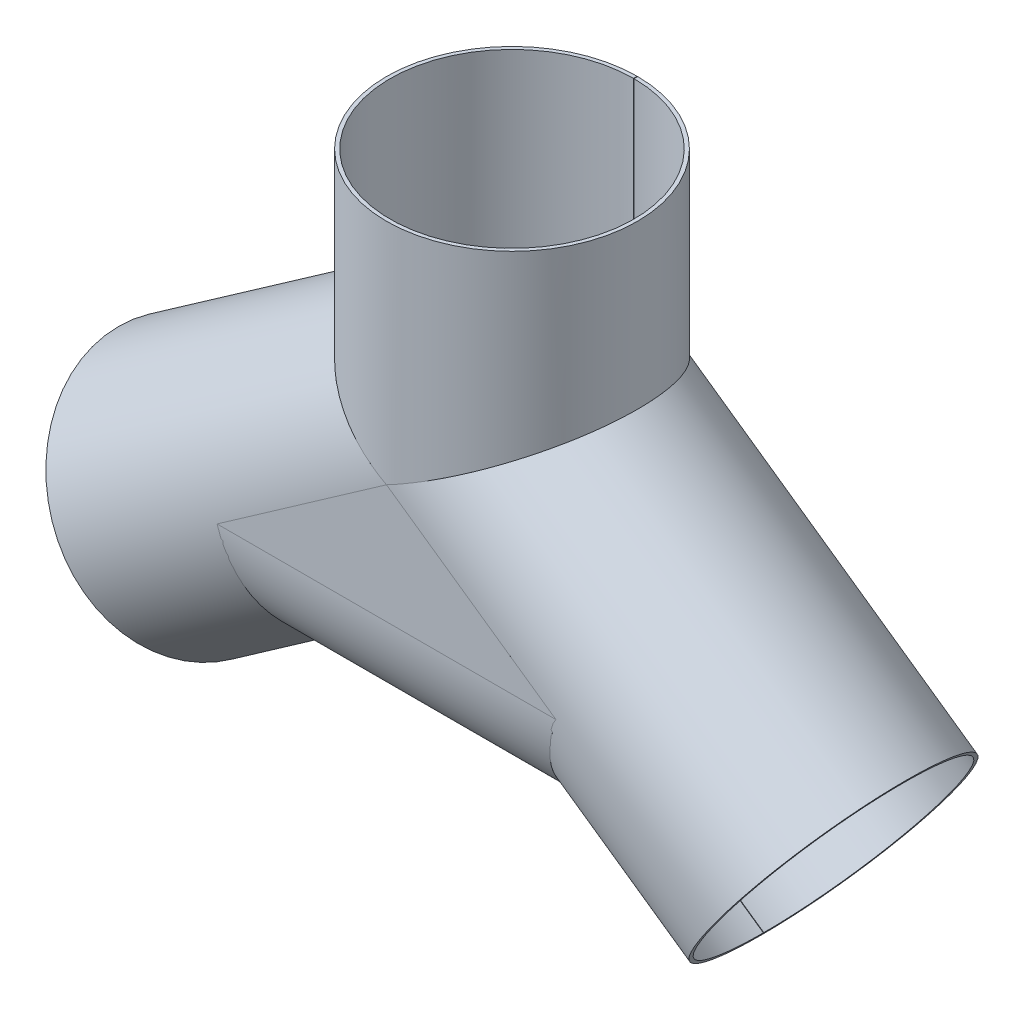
ISO-10303-21;
HEADER;
FILE_DESCRIPTION(('STEP AP214'),'2;1');
FILE_NAME('part.step','',(''),(''),'','','');
FILE_SCHEMA(('AUTOMOTIVE_DESIGN { 1 0 10303 214 1 1 1 1 }'));
ENDSEC;
DATA;
#1=APPLICATION_CONTEXT('core data for automotive mechanical design processes');
#2=APPLICATION_PROTOCOL_DEFINITION('international standard','automotive_design',2000,#1);
#3=PRODUCT_CONTEXT('',#1,'mechanical');
#4=PRODUCT('Part','Part','',(#3));
#5=PRODUCT_RELATED_PRODUCT_CATEGORY('part','',(#4));
#6=PRODUCT_DEFINITION_FORMATION('','',#4);
#7=PRODUCT_DEFINITION_CONTEXT('part definition',#1,'design');
#8=PRODUCT_DEFINITION('design','',#6,#7);
#9=PRODUCT_DEFINITION_SHAPE('','',#8);
#10=(LENGTH_UNIT() NAMED_UNIT(*) SI_UNIT(.MILLI.,.METRE.));
#11=(NAMED_UNIT(*) PLANE_ANGLE_UNIT() SI_UNIT($,.RADIAN.));
#12=(NAMED_UNIT(*) SI_UNIT($,.STERADIAN.) SOLID_ANGLE_UNIT());
#13=UNCERTAINTY_MEASURE_WITH_UNIT(LENGTH_MEASURE(1.E-05),#10,'distance_accuracy_value','');
#14=(GEOMETRIC_REPRESENTATION_CONTEXT(3) GLOBAL_UNCERTAINTY_ASSIGNED_CONTEXT((#13)) GLOBAL_UNIT_ASSIGNED_CONTEXT((#10,
#11,#12)) REPRESENTATION_CONTEXT('',''));
#15=CARTESIAN_POINT('',(0.,0.,0.));
#16=DIRECTION('',(0.,0.,1.));
#17=DIRECTION('',(1.,0.,0.));
#18=AXIS2_PLACEMENT_3D('',#15,#16,#17);
#19=CARTESIAN_POINT('',(-371.318481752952,-260.,0.));
#20=DIRECTION('',(1.,0.,0.));
#21=DIRECTION('',(0.,0.,-1.));
#22=AXIS2_PLACEMENT_3D('',#19,#20,#21);
#23=CYLINDRICAL_SURFACE('',#22,275.);
#24=DIRECTION('',(-1.,0.,0.));
#25=VECTOR('',#24,1.);
#26=CARTESIAN_POINT('',(3410.86627632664,-260.,-275.));
#27=LINE('',#26,#25);
#28=CARTESIAN_POINT('',(371.318481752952,-260.,-275.));
#29=VERTEX_POINT('',#28);
#30=CARTESIAN_POINT('',(-371.318481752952,-259.999999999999,-275.));
#31=VERTEX_POINT('',#30);
#32=EDGE_CURVE('E131',#29,#31,#27,.T.);
#33=ORIENTED_EDGE('',*,*,#32,.F.);
#34=CARTESIAN_POINT('',(371.318481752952,-260.,0.));
#35=DIRECTION('',(0.953716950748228,-0.300705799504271,0.));
#36=DIRECTION('',(0.300705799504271,0.953716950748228,0.));
#37=AXIS2_PLACEMENT_3D('',#34,#35,#36);
#38=ELLIPSE('',#37,288.345509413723,275.);
#39=CARTESIAN_POINT('',(371.318481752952,-260.,275.));
#40=VERTEX_POINT('',#39);
#41=EDGE_CURVE('E115',#29,#40,#38,.F.);
#42=ORIENTED_EDGE('',*,*,#41,.T.);
#43=DIRECTION('',(-1.,0.,0.));
#44=VECTOR('',#43,1.);
#45=CARTESIAN_POINT('',(3410.86627632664,-260.,275.));
#46=LINE('',#45,#44);
#47=CARTESIAN_POINT('',(-371.318481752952,-260.,275.));
#48=VERTEX_POINT('',#47);
#49=EDGE_CURVE('E129',#40,#48,#46,.T.);
#50=ORIENTED_EDGE('',*,*,#49,.T.);
#51=CARTESIAN_POINT('',(-371.318481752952,-260.,0.));
#52=DIRECTION('',(-0.953716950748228,-0.300705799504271,0.));
#53=DIRECTION('',(0.300705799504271,-0.953716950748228,0.));
#54=AXIS2_PLACEMENT_3D('',#51,#52,#53);
#55=ELLIPSE('',#54,288.345509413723,275.);
#56=EDGE_CURVE('E190',#48,#31,#55,.F.);
#57=ORIENTED_EDGE('',*,*,#56,.T.);
#58=EDGE_LOOP('',(#33,#42,#50,#57));
#59=FACE_BOUND('',#58,.T.);
#60=ADVANCED_FACE('F66',(#59),#23,.T.);
#61=CARTESIAN_POINT('',(-371.318481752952,-260.,0.));
#62=DIRECTION('',(1.,0.,0.));
#63=DIRECTION('',(0.,0.,-1.));
#64=AXIS2_PLACEMENT_3D('',#61,#62,#63);
#65=CYLINDRICAL_SURFACE('',#64,267.);
#66=CARTESIAN_POINT('',(371.318481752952,-260.,0.));
#67=DIRECTION('',(0.953716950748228,-0.300705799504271,0.));
#68=DIRECTION('',(0.300705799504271,0.953716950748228,0.));
#69=AXIS2_PLACEMENT_3D('',#66,#67,#68);
#70=ELLIPSE('',#69,279.957276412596,267.);
#71=CARTESIAN_POINT('',(371.318481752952,-260.,-267.));
#72=VERTEX_POINT('',#71);
#73=CARTESIAN_POINT('',(371.318481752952,-259.999999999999,267.));
#74=VERTEX_POINT('',#73);
#75=EDGE_CURVE('E118',#72,#74,#70,.F.);
#76=ORIENTED_EDGE('',*,*,#75,.F.);
#77=DIRECTION('',(1.,0.,0.));
#78=VECTOR('',#77,1.);
#79=CARTESIAN_POINT('',(-371.318481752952,-260.,-267.));
#80=LINE('',#79,#78);
#81=CARTESIAN_POINT('',(-371.318481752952,-260.,-267.));
#82=VERTEX_POINT('',#81);
#83=EDGE_CURVE('E157',#82,#72,#80,.T.);
#84=ORIENTED_EDGE('',*,*,#83,.F.);
#85=CARTESIAN_POINT('',(-371.318481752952,-260.,0.));
#86=DIRECTION('',(-0.953716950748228,-0.300705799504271,0.));
#87=DIRECTION('',(0.300705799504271,-0.953716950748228,0.));
#88=AXIS2_PLACEMENT_3D('',#85,#86,#87);
#89=ELLIPSE('',#88,279.957276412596,267.);
#90=CARTESIAN_POINT('',(-371.318481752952,-259.999999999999,267.));
#91=VERTEX_POINT('',#90);
#92=EDGE_CURVE('E132',#91,#82,#89,.F.);
#93=ORIENTED_EDGE('',*,*,#92,.F.);
#94=DIRECTION('',(1.,0.,0.));
#95=VECTOR('',#94,1.);
#96=CARTESIAN_POINT('',(-371.318481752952,-260.,267.));
#97=LINE('',#96,#95);
#98=EDGE_CURVE('E152',#74,#91,#97,.F.);
#99=ORIENTED_EDGE('',*,*,#98,.F.);
#100=EDGE_LOOP('',(#76,#84,#93,#99));
#101=FACE_BOUND('',#100,.T.);
#102=ADVANCED_FACE('F174',(#101),#65,.F.);
#103=CARTESIAN_POINT('',(-371.318481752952,-260.,267.));
#104=DIRECTION('',(-0.573576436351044,0.819152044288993,0.));
#105=DIRECTION('',(-0.819152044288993,-0.573576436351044,0.));
#106=AXIS2_PLACEMENT_3D('',#103,#104,#105);
#107=PLANE('',#106);
#108=DIRECTION('',(-0.819152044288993,-0.573576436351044,0.));
#109=VECTOR('',#108,1.);
#110=CARTESIAN_POINT('',(-371.318481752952,-260.,275.));
#111=LINE('',#110,#109);
#112=CARTESIAN_POINT('',(0.,0.,275.));
#113=VERTEX_POINT('',#112);
#114=EDGE_CURVE('E139',#113,#48,#111,.T.);
#115=ORIENTED_EDGE('',*,*,#114,.F.);
#116=DIRECTION('',(0.,0.,1.));
#117=VECTOR('',#116,1.);
#118=CARTESIAN_POINT('',(0.,0.,267.));
#119=LINE('',#118,#117);
#120=CARTESIAN_POINT('',(0.,0.,267.));
#121=VERTEX_POINT('',#120);
#122=EDGE_CURVE('E80',#121,#113,#119,.T.);
#123=ORIENTED_EDGE('',*,*,#122,.F.);
#124=DIRECTION('',(-0.819152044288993,-0.573576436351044,0.));
#125=VECTOR('',#124,1.);
#126=CARTESIAN_POINT('',(-371.318481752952,-260.,267.));
#127=LINE('',#126,#125);
#128=EDGE_CURVE('E143',#121,#91,#127,.T.);
#129=ORIENTED_EDGE('',*,*,#128,.T.);
#130=DIRECTION('',(0.,0.,1.));
#131=VECTOR('',#130,1.);
#132=CARTESIAN_POINT('',(-371.318481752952,-260.,0.));
#133=LINE('',#132,#131);
#134=EDGE_CURVE('E156',#91,#48,#133,.T.);
#135=ORIENTED_EDGE('',*,*,#134,.T.);
#136=EDGE_LOOP('',(#115,#123,#129,#135));
#137=FACE_BOUND('',#136,.T.);
#138=ADVANCED_FACE('F193',(#137),#107,.T.);
#139=CARTESIAN_POINT('',(0.,0.,267.));
#140=DIRECTION('',(0.573576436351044,0.819152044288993,0.));
#141=DIRECTION('',(-0.819152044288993,0.573576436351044,0.));
#142=AXIS2_PLACEMENT_3D('',#139,#140,#141);
#143=PLANE('',#142);
#144=DIRECTION('',(-0.819152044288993,0.573576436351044,0.));
#145=VECTOR('',#144,1.);
#146=CARTESIAN_POINT('',(0.,0.,275.));
#147=LINE('',#146,#145);
#148=EDGE_CURVE('E138',#40,#113,#147,.T.);
#149=ORIENTED_EDGE('',*,*,#148,.F.);
#150=DIRECTION('',(0.,0.,1.));
#151=VECTOR('',#150,1.);
#152=CARTESIAN_POINT('',(371.318481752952,-260.,0.));
#153=LINE('',#152,#151);
#154=EDGE_CURVE('E69',#74,#40,#153,.T.);
#155=ORIENTED_EDGE('',*,*,#154,.F.);
#156=DIRECTION('',(-0.819152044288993,0.573576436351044,0.));
#157=VECTOR('',#156,1.);
#158=CARTESIAN_POINT('',(0.,0.,267.));
#159=LINE('',#158,#157);
#160=EDGE_CURVE('E145',#74,#121,#159,.T.);
#161=ORIENTED_EDGE('',*,*,#160,.T.);
#162=ORIENTED_EDGE('',*,*,#122,.T.);
#163=EDGE_LOOP('',(#149,#155,#161,#162));
#164=FACE_BOUND('',#163,.T.);
#165=ADVANCED_FACE('F142',(#164),#143,.T.);
#166=CARTESIAN_POINT('',(0.,0.,267.));
#167=DIRECTION('',(0.,0.,-1.));
#168=DIRECTION('',(-1.,0.,0.));
#169=AXIS2_PLACEMENT_3D('',#166,#167,#168);
#170=PLANE('',#169);
#171=ORIENTED_EDGE('',*,*,#128,.F.);
#172=ORIENTED_EDGE('',*,*,#160,.F.);
#173=ORIENTED_EDGE('',*,*,#98,.T.);
#174=EDGE_LOOP('',(#171,#172,#173));
#175=FACE_BOUND('',#174,.T.);
#176=ADVANCED_FACE('F192',(#175),#170,.T.);
#177=CARTESIAN_POINT('',(0.,0.,275.));
#178=DIRECTION('',(0.,0.,-1.));
#179=DIRECTION('',(-1.,0.,0.));
#180=AXIS2_PLACEMENT_3D('',#177,#178,#179);
#181=PLANE('',#180);
#182=ORIENTED_EDGE('',*,*,#114,.T.);
#183=ORIENTED_EDGE('',*,*,#49,.F.);
#184=ORIENTED_EDGE('',*,*,#148,.T.);
#185=EDGE_LOOP('',(#182,#183,#184));
#186=FACE_BOUND('',#185,.T.);
#187=ADVANCED_FACE('F137',(#186),#181,.F.);
#188=CARTESIAN_POINT('',(-371.318481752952,-260.,-267.));
#189=DIRECTION('',(0.573576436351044,-0.819152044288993,0.));
#190=DIRECTION('',(0.819152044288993,0.573576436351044,0.));
#191=AXIS2_PLACEMENT_3D('',#188,#189,#190);
#192=PLANE('',#191);
#193=DIRECTION('',(-0.819152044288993,-0.573576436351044,0.));
#194=VECTOR('',#193,1.);
#195=CARTESIAN_POINT('',(-371.318481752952,-260.,-275.));
#196=LINE('',#195,#194);
#197=CARTESIAN_POINT('',(0.,0.,-275.));
#198=VERTEX_POINT('',#197);
#199=EDGE_CURVE('E170',#198,#31,#196,.T.);
#200=ORIENTED_EDGE('',*,*,#199,.T.);
#201=EDGE_CURVE('E123',#31,#82,#133,.T.);
#202=ORIENTED_EDGE('',*,*,#201,.T.);
#203=DIRECTION('',(-0.819152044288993,-0.573576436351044,0.));
#204=VECTOR('',#203,1.);
#205=CARTESIAN_POINT('',(-371.318481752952,-260.,-267.));
#206=LINE('',#205,#204);
#207=CARTESIAN_POINT('',(0.,0.,-267.));
#208=VERTEX_POINT('',#207);
#209=EDGE_CURVE('E168',#208,#82,#206,.T.);
#210=ORIENTED_EDGE('',*,*,#209,.F.);
#211=DIRECTION('',(0.,0.,-1.));
#212=VECTOR('',#211,1.);
#213=CARTESIAN_POINT('',(0.,0.,-267.));
#214=LINE('',#213,#212);
#215=EDGE_CURVE('E147',#208,#198,#214,.T.);
#216=ORIENTED_EDGE('',*,*,#215,.T.);
#217=EDGE_LOOP('',(#200,#202,#210,#216));
#218=FACE_BOUND('',#217,.T.);
#219=ADVANCED_FACE('F166',(#218),#192,.F.);
#220=CARTESIAN_POINT('',(0.,0.,-267.));
#221=DIRECTION('',(-0.573576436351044,-0.819152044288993,0.));
#222=DIRECTION('',(0.819152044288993,-0.573576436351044,0.));
#223=AXIS2_PLACEMENT_3D('',#220,#221,#222);
#224=PLANE('',#223);
#225=DIRECTION('',(-0.819152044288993,0.573576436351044,0.));
#226=VECTOR('',#225,1.);
#227=CARTESIAN_POINT('',(0.,0.,-275.));
#228=LINE('',#227,#226);
#229=EDGE_CURVE('E185',#29,#198,#228,.T.);
#230=ORIENTED_EDGE('',*,*,#229,.T.);
#231=ORIENTED_EDGE('',*,*,#215,.F.);
#232=DIRECTION('',(-0.819152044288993,0.573576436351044,0.));
#233=VECTOR('',#232,1.);
#234=CARTESIAN_POINT('',(0.,0.,-267.));
#235=LINE('',#234,#233);
#236=EDGE_CURVE('E180',#72,#208,#235,.T.);
#237=ORIENTED_EDGE('',*,*,#236,.F.);
#238=EDGE_CURVE('E14',#29,#72,#153,.T.);
#239=ORIENTED_EDGE('',*,*,#238,.F.);
#240=EDGE_LOOP('',(#230,#231,#237,#239));
#241=FACE_BOUND('',#240,.T.);
#242=ADVANCED_FACE('F181',(#241),#224,.F.);
#243=CARTESIAN_POINT('',(0.,0.,-267.));
#244=DIRECTION('',(0.,0.,1.));
#245=DIRECTION('',(-1.,0.,0.));
#246=AXIS2_PLACEMENT_3D('',#243,#244,#245);
#247=PLANE('',#246);
#248=ORIENTED_EDGE('',*,*,#209,.T.);
#249=ORIENTED_EDGE('',*,*,#83,.T.);
#250=ORIENTED_EDGE('',*,*,#236,.T.);
#251=EDGE_LOOP('',(#248,#249,#250));
#252=FACE_BOUND('',#251,.T.);
#253=ADVANCED_FACE('F199',(#252),#247,.T.);
#254=CARTESIAN_POINT('',(0.,0.,-275.));
#255=DIRECTION('',(0.,0.,1.));
#256=DIRECTION('',(-1.,0.,0.));
#257=AXIS2_PLACEMENT_3D('',#254,#255,#256);
#258=PLANE('',#257);
#259=ORIENTED_EDGE('',*,*,#199,.F.);
#260=ORIENTED_EDGE('',*,*,#229,.F.);
#261=ORIENTED_EDGE('',*,*,#32,.T.);
#262=EDGE_LOOP('',(#259,#260,#261));
#263=FACE_BOUND('',#262,.T.);
#264=ADVANCED_FACE('F197',(#263),#258,.F.);
#265=CARTESIAN_POINT('',(0.,-1437.67176674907,-275.));
#266=DIRECTION('',(0.953716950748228,-0.300705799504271,0.));
#267=DIRECTION('',(0.300705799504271,0.953716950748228,0.));
#268=AXIS2_PLACEMENT_3D('',#265,#266,#267);
#269=PLANE('',#268);
#270=ORIENTED_EDGE('',*,*,#41,.F.);
#271=ORIENTED_EDGE('',*,*,#238,.T.);
#272=ORIENTED_EDGE('',*,*,#75,.T.);
#273=ORIENTED_EDGE('',*,*,#154,.T.);
#274=EDGE_LOOP('',(#270,#271,#272,#273));
#275=FACE_BOUND('',#274,.T.);
#276=ADVANCED_FACE('F114',(#275),#269,.T.);
#277=CARTESIAN_POINT('',(-742.636963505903,917.671766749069,-275.));
#278=DIRECTION('',(-0.953716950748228,-0.300705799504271,0.));
#279=DIRECTION('',(0.300705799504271,-0.953716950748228,0.));
#280=AXIS2_PLACEMENT_3D('',#277,#278,#279);
#281=PLANE('',#280);
#282=ORIENTED_EDGE('',*,*,#134,.F.);
#283=ORIENTED_EDGE('',*,*,#92,.T.);
#284=ORIENTED_EDGE('',*,*,#201,.F.);
#285=ORIENTED_EDGE('',*,*,#56,.F.);
#286=EDGE_LOOP('',(#282,#283,#284,#285));
#287=FACE_BOUND('',#286,.T.);
#288=ADVANCED_FACE('F194',(#287),#281,.T.);
#289=CLOSED_SHELL('',(#60,#102,#138,#165,#176,#187,#219,#242,#253,#264,#276,#288));
#290=MANIFOLD_SOLID_BREP('B2',#289);
#291=CARTESIAN_POINT('',(1.11022302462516E-13,1.66533453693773E-13,0.));
#292=DIRECTION('',(-0.819152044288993,-0.573576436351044,0.));
#293=DIRECTION('',(-0.573576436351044,0.819152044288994,0.));
#294=AXIS2_PLACEMENT_3D('',#291,#292,#293);
#295=CYLINDRICAL_SURFACE('',#294,275.);
#296=CARTESIAN_POINT('',(-704.470758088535,-493.275735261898,0.));
#297=DIRECTION('',(0.819152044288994,0.573576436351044,0.));
#298=DIRECTION('',(-0.573576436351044,0.819152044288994,0.));
#299=AXIS2_PLACEMENT_3D('',#296,#297,#298);
#300=CIRCLE('',#299,275.);
#301=CARTESIAN_POINT('',(-546.737498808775,-718.542175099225,-0.500000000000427));
#302=VERTEX_POINT('',#301);
#303=CARTESIAN_POINT('',(-546.737498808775,-718.542175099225,0.499999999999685));
#304=VERTEX_POINT('',#303);
#305=EDGE_CURVE('E371',#302,#304,#300,.T.);
#306=ORIENTED_EDGE('',*,*,#305,.T.);
#307=DIRECTION('',(-0.819152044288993,-0.573576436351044,0.));
#308=VECTOR('',#307,1.);
#309=CARTESIAN_POINT('',(157.73325927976,-225.266439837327,0.499999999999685));
#310=LINE('',#309,#308);
#311=CARTESIAN_POINT('',(0.,-335.712457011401,0.499999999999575));
#312=VERTEX_POINT('',#311);
#313=EDGE_CURVE('E360',#304,#312,#310,.F.);
#314=ORIENTED_EDGE('',*,*,#313,.T.);
#315=CARTESIAN_POINT('',(0.,1.12068877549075E-13,0.));
#316=DIRECTION('',(-1.,0.,0.));
#317=DIRECTION('',(0.,-1.,0.));
#318=AXIS2_PLACEMENT_3D('',#315,#316,#317);
#319=ELLIPSE('',#318,335.7130119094,275.);
#320=CARTESIAN_POINT('',(0.,6.66133814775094E-13,275.));
#321=VERTEX_POINT('',#320);
#322=EDGE_CURVE('E372',#321,#312,#319,.F.);
#323=ORIENTED_EDGE('',*,*,#322,.F.);
#324=CARTESIAN_POINT('',(4.18608667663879E-13,3.81907745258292E-13,0.));
#325=DIRECTION('',(0.461748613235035,0.887010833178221,0.));
#326=DIRECTION('',(-0.887010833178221,0.461748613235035,0.));
#327=AXIS2_PLACEMENT_3D('',#324,#325,#326);
#328=ELLIPSE('',#327,310.030035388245,275.);
#329=CARTESIAN_POINT('',(-3.02707862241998E-13,7.57401363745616E-13,-275.));
#330=VERTEX_POINT('',#329);
#331=EDGE_CURVE('E389',#321,#330,#328,.F.);
#332=ORIENTED_EDGE('',*,*,#331,.T.);
#333=CARTESIAN_POINT('',(0.,-335.712457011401,-0.500000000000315));
#334=VERTEX_POINT('',#333);
#335=EDGE_CURVE('E395',#334,#330,#319,.F.);
#336=ORIENTED_EDGE('',*,*,#335,.F.);
#337=DIRECTION('',(-0.819152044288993,-0.573576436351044,0.));
#338=VECTOR('',#337,1.);
#339=CARTESIAN_POINT('',(157.73325927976,-225.266439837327,-0.500000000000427));
#340=LINE('',#339,#338);
#341=EDGE_CURVE('E384',#302,#334,#340,.F.);
#342=ORIENTED_EDGE('',*,*,#341,.F.);
#343=EDGE_LOOP('',(#306,#314,#323,#332,#336,#342));
#344=FACE_BOUND('',#343,.T.);
#345=ADVANCED_FACE('F305',(#344),#295,.T.);
#346=CARTESIAN_POINT('',(1.11022302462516E-13,1.66533453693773E-13,0.));
#347=DIRECTION('',(-0.819152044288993,-0.573576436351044,0.));
#348=DIRECTION('',(-0.573576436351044,0.819152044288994,0.));
#349=AXIS2_PLACEMENT_3D('',#346,#347,#348);
#350=CYLINDRICAL_SURFACE('',#349,267.);
#351=DIRECTION('',(-0.819152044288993,-0.573576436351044,0.));
#352=VECTOR('',#351,1.);
#353=CARTESIAN_POINT('',(153.144639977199,-218.713212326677,-0.500000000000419));
#354=LINE('',#353,#352);
#355=CARTESIAN_POINT('',(-551.326118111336,-711.988947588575,-0.500000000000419));
#356=VERTEX_POINT('',#355);
#357=CARTESIAN_POINT('',(0.,-325.946243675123,-0.500000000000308));
#358=VERTEX_POINT('',#357);
#359=EDGE_CURVE('E379',#356,#358,#354,.F.);
#360=ORIENTED_EDGE('',*,*,#359,.T.);
#361=CARTESIAN_POINT('',(0.,1.12068877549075E-13,0.));
#362=DIRECTION('',(-1.,0.,0.));
#363=DIRECTION('',(0.,-1.,0.));
#364=AXIS2_PLACEMENT_3D('',#361,#362,#363);
#365=ELLIPSE('',#364,325.946815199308,267.);
#366=CARTESIAN_POINT('',(-3.02707862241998E-13,7.57401363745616E-13,-267.));
#367=VERTEX_POINT('',#366);
#368=EDGE_CURVE('E398',#358,#367,#365,.F.);
#369=ORIENTED_EDGE('',*,*,#368,.T.);
#370=CARTESIAN_POINT('',(4.18608667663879E-13,3.81907745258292E-13,0.));
#371=DIRECTION('',(0.461748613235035,0.887010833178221,0.));
#372=DIRECTION('',(-0.887010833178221,0.461748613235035,0.));
#373=AXIS2_PLACEMENT_3D('',#370,#371,#372);
#374=ELLIPSE('',#373,301.010979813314,267.);
#375=CARTESIAN_POINT('',(0.,2.7761976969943E-13,267.));
#376=VERTEX_POINT('',#375);
#377=EDGE_CURVE('E386',#376,#367,#374,.F.);
#378=ORIENTED_EDGE('',*,*,#377,.F.);
#379=CARTESIAN_POINT('',(0.,-325.946243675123,0.499999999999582));
#380=VERTEX_POINT('',#379);
#381=EDGE_CURVE('E377',#376,#380,#365,.F.);
#382=ORIENTED_EDGE('',*,*,#381,.T.);
#383=DIRECTION('',(-0.819152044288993,-0.573576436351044,0.));
#384=VECTOR('',#383,1.);
#385=CARTESIAN_POINT('',(153.144639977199,-218.713212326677,0.499999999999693));
#386=LINE('',#385,#384);
#387=CARTESIAN_POINT('',(-551.326118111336,-711.988947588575,0.499999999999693));
#388=VERTEX_POINT('',#387);
#389=EDGE_CURVE('E357',#388,#380,#386,.F.);
#390=ORIENTED_EDGE('',*,*,#389,.F.);
#391=CARTESIAN_POINT('',(-704.470758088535,-493.275735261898,0.));
#392=DIRECTION('',(0.819152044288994,0.573576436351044,0.));
#393=DIRECTION('',(0.,0.,-1.));
#394=AXIS2_PLACEMENT_3D('',#391,#392,#393);
#395=CIRCLE('',#394,267.);
#396=EDGE_CURVE('E367',#356,#388,#395,.T.);
#397=ORIENTED_EDGE('',*,*,#396,.F.);
#398=EDGE_LOOP('',(#360,#369,#378,#382,#390,#397));
#399=FACE_BOUND('',#398,.T.);
#400=ADVANCED_FACE('F374',(#399),#350,.F.);
#401=CARTESIAN_POINT('',(-704.470758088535,-493.275735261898,0.));
#402=DIRECTION('',(-0.819152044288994,-0.573576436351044,0.));
#403=DIRECTION('',(-0.573576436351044,0.819152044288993,0.));
#404=AXIS2_PLACEMENT_3D('',#401,#402,#403);
#405=PLANE('',#404);
#406=ORIENTED_EDGE('',*,*,#396,.T.);
#407=DIRECTION('',(0.573576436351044,-0.819152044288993,0.));
#408=VECTOR('',#407,1.);
#409=CARTESIAN_POINT('',(-704.470758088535,-493.275735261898,0.499999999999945));
#410=LINE('',#409,#408);
#411=EDGE_CURVE('E353',#388,#304,#410,.T.);
#412=ORIENTED_EDGE('',*,*,#411,.T.);
#413=ORIENTED_EDGE('',*,*,#305,.F.);
#414=DIRECTION('',(0.573576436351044,-0.819152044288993,0.));
#415=VECTOR('',#414,1.);
#416=CARTESIAN_POINT('',(-704.470758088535,-493.275735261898,-0.500000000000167));
#417=LINE('',#416,#415);
#418=EDGE_CURVE('E364',#356,#302,#417,.T.);
#419=ORIENTED_EDGE('',*,*,#418,.F.);
#420=EDGE_LOOP('',(#406,#412,#413,#419));
#421=FACE_BOUND('',#420,.T.);
#422=ADVANCED_FACE('F368',(#421),#405,.T.);
#423=CARTESIAN_POINT('',(0.,-718.542547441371,2537.69746619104));
#424=DIRECTION('',(1.,0.,0.));
#425=DIRECTION('',(0.,-1.,0.));
#426=AXIS2_PLACEMENT_3D('',#423,#424,#425);
#427=PLANE('',#426);
#428=ORIENTED_EDGE('',*,*,#335,.T.);
#429=DIRECTION('',(0.,0.,-1.));
#430=VECTOR('',#429,1.);
#431=CARTESIAN_POINT('',(0.,2.7761976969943E-13,0.));
#432=LINE('',#431,#430);
#433=EDGE_CURVE('E392',#367,#330,#432,.T.);
#434=ORIENTED_EDGE('',*,*,#433,.F.);
#435=ORIENTED_EDGE('',*,*,#368,.F.);
#436=DIRECTION('',(0.,1.,0.));
#437=VECTOR('',#436,1.);
#438=CARTESIAN_POINT('',(0.,-718.542547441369,-0.500000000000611));
#439=LINE('',#438,#437);
#440=EDGE_CURVE('E64',#334,#358,#439,.T.);
#441=ORIENTED_EDGE('',*,*,#440,.F.);
#442=EDGE_LOOP('',(#428,#434,#435,#441));
#443=FACE_BOUND('',#442,.T.);
#444=ADVANCED_FACE('F410',(#443),#427,.T.);
#445=DIRECTION('',(0.,1.,0.));
#446=VECTOR('',#445,1.);
#447=CARTESIAN_POINT('',(0.,-718.542547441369,0.499999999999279));
#448=LINE('',#447,#446);
#449=EDGE_CURVE('E312',#312,#380,#448,.T.);
#450=ORIENTED_EDGE('',*,*,#449,.T.);
#451=ORIENTED_EDGE('',*,*,#381,.F.);
#452=EDGE_CURVE('E394',#321,#376,#432,.T.);
#453=ORIENTED_EDGE('',*,*,#452,.F.);
#454=ORIENTED_EDGE('',*,*,#322,.T.);
#455=EDGE_LOOP('',(#450,#451,#453,#454));
#456=FACE_BOUND('',#455,.T.);
#457=ADVANCED_FACE('F400',(#456),#427,.T.);
#458=CARTESIAN_POINT('',(-704.470758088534,366.724264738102,2537.69746619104));
#459=DIRECTION('',(-0.461748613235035,-0.887010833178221,0.));
#460=DIRECTION('',(-0.887010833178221,0.461748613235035,0.));
#461=AXIS2_PLACEMENT_3D('',#458,#459,#460);
#462=PLANE('',#461);
#463=ORIENTED_EDGE('',*,*,#452,.T.);
#464=ORIENTED_EDGE('',*,*,#377,.T.);
#465=ORIENTED_EDGE('',*,*,#433,.T.);
#466=ORIENTED_EDGE('',*,*,#331,.F.);
#467=EDGE_LOOP('',(#463,#464,#465,#466));
#468=FACE_BOUND('',#467,.T.);
#469=ADVANCED_FACE('F412',(#468),#462,.F.);
#470=CARTESIAN_POINT('',(-2.22044604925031E-13,1.11022302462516E-13,0.499999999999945));
#471=DIRECTION('',(0.,0.,1.));
#472=DIRECTION('',(0.,-1.,0.));
#473=AXIS2_PLACEMENT_3D('',#470,#471,#472);
#474=PLANE('',#473);
#475=ORIENTED_EDGE('',*,*,#313,.F.);
#476=ORIENTED_EDGE('',*,*,#411,.F.);
#477=ORIENTED_EDGE('',*,*,#389,.T.);
#478=ORIENTED_EDGE('',*,*,#449,.F.);
#479=EDGE_LOOP('',(#475,#476,#477,#478));
#480=FACE_BOUND('',#479,.T.);
#481=ADVANCED_FACE('F355',(#480),#474,.F.);
#482=CARTESIAN_POINT('',(-2.22044604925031E-13,1.11022302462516E-13,-0.500000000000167));
#483=DIRECTION('',(0.,0.,1.));
#484=DIRECTION('',(0.,-1.,0.));
#485=AXIS2_PLACEMENT_3D('',#482,#483,#484);
#486=PLANE('',#485);
#487=ORIENTED_EDGE('',*,*,#418,.T.);
#488=ORIENTED_EDGE('',*,*,#341,.T.);
#489=ORIENTED_EDGE('',*,*,#440,.T.);
#490=ORIENTED_EDGE('',*,*,#359,.F.);
#491=EDGE_LOOP('',(#487,#488,#489,#490));
#492=FACE_BOUND('',#491,.T.);
#493=ADVANCED_FACE('F407',(#492),#486,.T.);
#494=CLOSED_SHELL('',(#345,#400,#422,#444,#457,#469,#481,#493));
#495=MANIFOLD_SOLID_BREP('B8',#494);
#496=CARTESIAN_POINT('',(-1.11022302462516E-13,1.66533453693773E-13,0.));
#497=DIRECTION('',(0.819152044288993,-0.573576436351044,0.));
#498=DIRECTION('',(0.573576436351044,0.819152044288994,0.));
#499=AXIS2_PLACEMENT_3D('',#496,#497,#498);
#500=CYLINDRICAL_SURFACE('',#499,275.);
#501=CARTESIAN_POINT('',(704.470758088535,-493.275735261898,0.));
#502=DIRECTION('',(0.819152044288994,-0.573576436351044,0.));
#503=DIRECTION('',(0.573576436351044,0.819152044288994,0.));
#504=AXIS2_PLACEMENT_3D('',#501,#502,#503);
#505=CIRCLE('',#504,275.);
#506=CARTESIAN_POINT('',(546.737498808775,-718.542175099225,-0.500000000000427));
#507=VERTEX_POINT('',#506);
#508=CARTESIAN_POINT('',(546.737498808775,-718.542175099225,0.499999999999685));
#509=VERTEX_POINT('',#508);
#510=EDGE_CURVE('E550',#507,#509,#505,.T.);
#511=ORIENTED_EDGE('',*,*,#510,.F.);
#512=DIRECTION('',(0.819152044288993,-0.573576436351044,0.));
#513=VECTOR('',#512,1.);
#514=CARTESIAN_POINT('',(-157.73325927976,-225.266439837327,-0.500000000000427));
#515=LINE('',#514,#513);
#516=CARTESIAN_POINT('',(0.,-335.712457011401,-0.500000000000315));
#517=VERTEX_POINT('',#516);
#518=EDGE_CURVE('E581',#507,#517,#515,.F.);
#519=ORIENTED_EDGE('',*,*,#518,.T.);
#520=CARTESIAN_POINT('',(0.,1.12068877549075E-13,0.));
#521=DIRECTION('',(-1.,0.,0.));
#522=DIRECTION('',(0.,-1.,0.));
#523=AXIS2_PLACEMENT_3D('',#520,#521,#522);
#524=ELLIPSE('',#523,335.7130119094,275.);
#525=CARTESIAN_POINT('',(3.02707862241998E-13,7.57401363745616E-13,-275.));
#526=VERTEX_POINT('',#525);
#527=EDGE_CURVE('E560',#517,#526,#524,.F.);
#528=ORIENTED_EDGE('',*,*,#527,.T.);
#529=CARTESIAN_POINT('',(-4.18608667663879E-13,3.81907745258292E-13,0.));
#530=DIRECTION('',(0.461748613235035,-0.887010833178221,0.));
#531=DIRECTION('',(0.887010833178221,0.461748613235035,0.));
#532=AXIS2_PLACEMENT_3D('',#529,#530,#531);
#533=ELLIPSE('',#532,310.030035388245,275.);
#534=CARTESIAN_POINT('',(0.,6.66133814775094E-13,275.));
#535=VERTEX_POINT('',#534);
#536=EDGE_CURVE('E579',#535,#526,#533,.F.);
#537=ORIENTED_EDGE('',*,*,#536,.F.);
#538=CARTESIAN_POINT('',(0.,-335.712457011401,0.499999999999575));
#539=VERTEX_POINT('',#538);
#540=EDGE_CURVE('E555',#535,#539,#524,.F.);
#541=ORIENTED_EDGE('',*,*,#540,.T.);
#542=DIRECTION('',(0.819152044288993,-0.573576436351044,0.));
#543=VECTOR('',#542,1.);
#544=CARTESIAN_POINT('',(-157.73325927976,-225.266439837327,0.499999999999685));
#545=LINE('',#544,#543);
#546=EDGE_CURVE('E506',#509,#539,#545,.F.);
#547=ORIENTED_EDGE('',*,*,#546,.F.);
#548=EDGE_LOOP('',(#511,#519,#528,#537,#541,#547));
#549=FACE_BOUND('',#548,.T.);
#550=ADVANCED_FACE('F485',(#549),#500,.T.);
#551=CARTESIAN_POINT('',(-1.11022302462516E-13,1.66533453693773E-13,0.));
#552=DIRECTION('',(0.819152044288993,-0.573576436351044,0.));
#553=DIRECTION('',(0.573576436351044,0.819152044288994,0.));
#554=AXIS2_PLACEMENT_3D('',#551,#552,#553);
#555=CYLINDRICAL_SURFACE('',#554,267.);
#556=DIRECTION('',(0.819152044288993,-0.573576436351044,0.));
#557=VECTOR('',#556,1.);
#558=CARTESIAN_POINT('',(-153.144639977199,-218.713212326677,-0.500000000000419));
#559=LINE('',#558,#557);
#560=CARTESIAN_POINT('',(551.326118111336,-711.988947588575,-0.500000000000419));
#561=VERTEX_POINT('',#560);
#562=CARTESIAN_POINT('',(0.,-325.946243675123,-0.500000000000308));
#563=VERTEX_POINT('',#562);
#564=EDGE_CURVE('E499',#561,#563,#559,.F.);
#565=ORIENTED_EDGE('',*,*,#564,.F.);
#566=CARTESIAN_POINT('',(704.470758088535,-493.275735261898,0.));
#567=DIRECTION('',(0.819152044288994,-0.573576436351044,0.));
#568=DIRECTION('',(0.,0.,-1.));
#569=AXIS2_PLACEMENT_3D('',#566,#567,#568);
#570=CIRCLE('',#569,267.);
#571=CARTESIAN_POINT('',(551.326118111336,-711.988947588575,0.499999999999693));
#572=VERTEX_POINT('',#571);
#573=EDGE_CURVE('E548',#561,#572,#570,.T.);
#574=ORIENTED_EDGE('',*,*,#573,.T.);
#575=DIRECTION('',(0.819152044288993,-0.573576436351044,0.));
#576=VECTOR('',#575,1.);
#577=CARTESIAN_POINT('',(-153.144639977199,-218.713212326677,0.499999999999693));
#578=LINE('',#577,#576);
#579=CARTESIAN_POINT('',(0.,-325.946243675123,0.499999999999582));
#580=VERTEX_POINT('',#579);
#581=EDGE_CURVE('E534',#572,#580,#578,.F.);
#582=ORIENTED_EDGE('',*,*,#581,.T.);
#583=CARTESIAN_POINT('',(0.,1.12068877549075E-13,0.));
#584=DIRECTION('',(-1.,0.,0.));
#585=DIRECTION('',(0.,-1.,0.));
#586=AXIS2_PLACEMENT_3D('',#583,#584,#585);
#587=ELLIPSE('',#586,325.946815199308,267.);
#588=CARTESIAN_POINT('',(0.,2.7761976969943E-13,267.));
#589=VERTEX_POINT('',#588);
#590=EDGE_CURVE('E564',#589,#580,#587,.F.);
#591=ORIENTED_EDGE('',*,*,#590,.F.);
#592=CARTESIAN_POINT('',(-4.18608667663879E-13,3.81907745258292E-13,0.));
#593=DIRECTION('',(0.461748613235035,-0.887010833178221,0.));
#594=DIRECTION('',(0.887010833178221,0.461748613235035,0.));
#595=AXIS2_PLACEMENT_3D('',#592,#593,#594);
#596=ELLIPSE('',#595,301.010979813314,267.);
#597=CARTESIAN_POINT('',(3.02707862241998E-13,7.57401363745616E-13,-267.));
#598=VERTEX_POINT('',#597);
#599=EDGE_CURVE('E577',#589,#598,#596,.F.);
#600=ORIENTED_EDGE('',*,*,#599,.T.);
#601=EDGE_CURVE('E557',#563,#598,#587,.F.);
#602=ORIENTED_EDGE('',*,*,#601,.F.);
#603=EDGE_LOOP('',(#565,#574,#582,#591,#600,#602));
#604=FACE_BOUND('',#603,.T.);
#605=ADVANCED_FACE('F553',(#604),#555,.F.);
#606=CARTESIAN_POINT('',(704.470758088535,-493.275735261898,0.));
#607=DIRECTION('',(0.819152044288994,-0.573576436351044,0.));
#608=DIRECTION('',(0.573576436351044,0.819152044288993,0.));
#609=AXIS2_PLACEMENT_3D('',#606,#607,#608);
#610=PLANE('',#609);
#611=ORIENTED_EDGE('',*,*,#573,.F.);
#612=DIRECTION('',(-0.573576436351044,-0.819152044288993,0.));
#613=VECTOR('',#612,1.);
#614=CARTESIAN_POINT('',(704.470758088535,-493.275735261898,-0.500000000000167));
#615=LINE('',#614,#613);
#616=EDGE_CURVE('E551',#561,#507,#615,.T.);
#617=ORIENTED_EDGE('',*,*,#616,.T.);
#618=ORIENTED_EDGE('',*,*,#510,.T.);
#619=DIRECTION('',(-0.573576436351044,-0.819152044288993,0.));
#620=VECTOR('',#619,1.);
#621=CARTESIAN_POINT('',(704.470758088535,-493.275735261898,0.499999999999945));
#622=LINE('',#621,#620);
#623=EDGE_CURVE('E537',#572,#509,#622,.T.);
#624=ORIENTED_EDGE('',*,*,#623,.F.);
#625=EDGE_LOOP('',(#611,#617,#618,#624));
#626=FACE_BOUND('',#625,.T.);
#627=ADVANCED_FACE('F546',(#626),#610,.T.);
#628=CARTESIAN_POINT('',(0.,-718.542547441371,2537.69746619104));
#629=DIRECTION('',(-1.,0.,0.));
#630=DIRECTION('',(0.,-1.,0.));
#631=AXIS2_PLACEMENT_3D('',#628,#629,#630);
#632=PLANE('',#631);
#633=ORIENTED_EDGE('',*,*,#527,.F.);
#634=DIRECTION('',(0.,1.,0.));
#635=VECTOR('',#634,1.);
#636=CARTESIAN_POINT('',(0.,-718.542547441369,-0.500000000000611));
#637=LINE('',#636,#635);
#638=EDGE_CURVE('E303',#517,#563,#637,.T.);
#639=ORIENTED_EDGE('',*,*,#638,.T.);
#640=ORIENTED_EDGE('',*,*,#601,.T.);
#641=DIRECTION('',(0.,0.,-1.));
#642=VECTOR('',#641,1.);
#643=CARTESIAN_POINT('',(0.,2.7761976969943E-13,0.));
#644=LINE('',#643,#642);
#645=EDGE_CURVE('E572',#598,#526,#644,.T.);
#646=ORIENTED_EDGE('',*,*,#645,.T.);
#647=EDGE_LOOP('',(#633,#639,#640,#646));
#648=FACE_BOUND('',#647,.T.);
#649=ADVANCED_FACE('F571',(#648),#632,.T.);
#650=DIRECTION('',(0.,1.,0.));
#651=VECTOR('',#650,1.);
#652=CARTESIAN_POINT('',(0.,-718.542547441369,0.499999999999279));
#653=LINE('',#652,#651);
#654=EDGE_CURVE('E492',#539,#580,#653,.T.);
#655=ORIENTED_EDGE('',*,*,#654,.F.);
#656=ORIENTED_EDGE('',*,*,#540,.F.);
#657=EDGE_CURVE('E580',#535,#589,#644,.T.);
#658=ORIENTED_EDGE('',*,*,#657,.T.);
#659=ORIENTED_EDGE('',*,*,#590,.T.);
#660=EDGE_LOOP('',(#655,#656,#658,#659));
#661=FACE_BOUND('',#660,.T.);
#662=ADVANCED_FACE('F591',(#661),#632,.T.);
#663=CARTESIAN_POINT('',(704.470758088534,366.724264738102,2537.69746619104));
#664=DIRECTION('',(0.461748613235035,-0.887010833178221,0.));
#665=DIRECTION('',(0.887010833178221,0.461748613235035,0.));
#666=AXIS2_PLACEMENT_3D('',#663,#664,#665);
#667=PLANE('',#666);
#668=ORIENTED_EDGE('',*,*,#657,.F.);
#669=ORIENTED_EDGE('',*,*,#536,.T.);
#670=ORIENTED_EDGE('',*,*,#645,.F.);
#671=ORIENTED_EDGE('',*,*,#599,.F.);
#672=EDGE_LOOP('',(#668,#669,#670,#671));
#673=FACE_BOUND('',#672,.T.);
#674=ADVANCED_FACE('F576',(#673),#667,.F.);
#675=CARTESIAN_POINT('',(2.22044604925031E-13,1.11022302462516E-13,0.499999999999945));
#676=DIRECTION('',(0.,0.,1.));
#677=DIRECTION('',(0.,-1.,0.));
#678=AXIS2_PLACEMENT_3D('',#675,#676,#677);
#679=PLANE('',#678);
#680=ORIENTED_EDGE('',*,*,#546,.T.);
#681=ORIENTED_EDGE('',*,*,#654,.T.);
#682=ORIENTED_EDGE('',*,*,#581,.F.);
#683=ORIENTED_EDGE('',*,*,#623,.T.);
#684=EDGE_LOOP('',(#680,#681,#682,#683));
#685=FACE_BOUND('',#684,.T.);
#686=ADVANCED_FACE('F536',(#685),#679,.F.);
#687=CARTESIAN_POINT('',(2.22044604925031E-13,1.11022302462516E-13,-0.500000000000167));
#688=DIRECTION('',(0.,0.,1.));
#689=DIRECTION('',(0.,-1.,0.));
#690=AXIS2_PLACEMENT_3D('',#687,#688,#689);
#691=PLANE('',#690);
#692=ORIENTED_EDGE('',*,*,#616,.F.);
#693=ORIENTED_EDGE('',*,*,#564,.T.);
#694=ORIENTED_EDGE('',*,*,#638,.F.);
#695=ORIENTED_EDGE('',*,*,#518,.F.);
#696=EDGE_LOOP('',(#692,#693,#694,#695));
#697=FACE_BOUND('',#696,.T.);
#698=ADVANCED_FACE('F627',(#697),#691,.T.);
#699=CLOSED_SHELL('',(#550,#605,#627,#649,#662,#674,#686,#698));
#700=MANIFOLD_SOLID_BREP('B58',#699);
#701=CARTESIAN_POINT('',(0.,500.,0.));
#702=DIRECTION('',(0.,-1.,0.));
#703=DIRECTION('',(0.,0.,-1.));
#704=AXIS2_PLACEMENT_3D('',#701,#702,#703);
#705=CYLINDRICAL_SURFACE('',#704,275.);
#706=CARTESIAN_POINT('',(0.,500.,0.));
#707=DIRECTION('',(0.,1.,0.));
#708=DIRECTION('',(0.,0.,1.));
#709=AXIS2_PLACEMENT_3D('',#706,#707,#708);
#710=CIRCLE('',#709,275.);
#711=CARTESIAN_POINT('',(-0.500000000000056,500.,-274.99954545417));
#712=VERTEX_POINT('',#711);
#713=CARTESIAN_POINT('',(0.499999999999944,500.,-274.99954545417));
#714=VERTEX_POINT('',#713);
#715=EDGE_CURVE('E713',#712,#714,#710,.T.);
#716=ORIENTED_EDGE('',*,*,#715,.F.);
#717=DIRECTION('',(0.,-1.,0.));
#718=VECTOR('',#717,1.);
#719=CARTESIAN_POINT('',(-0.500000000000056,500.,-274.99954545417));
#720=LINE('',#719,#718);
#721=CARTESIAN_POINT('',(-0.500000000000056,0.260283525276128,-274.99954545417));
#722=VERTEX_POINT('',#721);
#723=EDGE_CURVE('E740',#712,#722,#720,.T.);
#724=ORIENTED_EDGE('',*,*,#723,.T.);
#725=CARTESIAN_POINT('',(0.,2.77555756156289E-13,0.));
#726=DIRECTION('',(0.461748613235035,0.887010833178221,0.));
#727=DIRECTION('',(0.887010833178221,-0.461748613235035,0.));
#728=AXIS2_PLACEMENT_3D('',#725,#726,#727);
#729=ELLIPSE('',#728,310.030035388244,275.);
#730=CARTESIAN_POINT('',(5.33179646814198E-13,0.,275.));
#731=VERTEX_POINT('',#730);
#732=EDGE_CURVE('E723',#722,#731,#729,.T.);
#733=ORIENTED_EDGE('',*,*,#732,.T.);
#734=CARTESIAN_POINT('',(0.,6.10622663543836E-13,0.));
#735=DIRECTION('',(0.461748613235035,-0.887010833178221,0.));
#736=DIRECTION('',(-0.887010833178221,-0.461748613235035,0.));
#737=AXIS2_PLACEMENT_3D('',#734,#735,#736);
#738=ELLIPSE('',#737,310.030035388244,275.);
#739=CARTESIAN_POINT('',(0.499999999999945,0.260283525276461,-274.999545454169));
#740=VERTEX_POINT('',#739);
#741=EDGE_CURVE('E715',#740,#731,#738,.T.);
#742=ORIENTED_EDGE('',*,*,#741,.F.);
#743=DIRECTION('',(0.,-1.,0.));
#744=VECTOR('',#743,1.);
#745=CARTESIAN_POINT('',(0.499999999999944,500.,-274.99954545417));
#746=LINE('',#745,#744);
#747=EDGE_CURVE('E677',#714,#740,#746,.T.);
#748=ORIENTED_EDGE('',*,*,#747,.F.);
#749=EDGE_LOOP('',(#716,#724,#733,#742,#748));
#750=FACE_BOUND('',#749,.T.);
#751=ADVANCED_FACE('F656',(#750),#705,.T.);
#752=CARTESIAN_POINT('',(704.470758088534,366.724264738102,2537.69746619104));
#753=DIRECTION('',(0.461748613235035,-0.887010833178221,0.));
#754=DIRECTION('',(0.887010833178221,0.461748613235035,0.));
#755=AXIS2_PLACEMENT_3D('',#752,#753,#754);
#756=PLANE('',#755);
#757=CARTESIAN_POINT('',(0.,6.10622663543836E-13,0.));
#758=DIRECTION('',(0.461748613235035,-0.887010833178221,0.));
#759=DIRECTION('',(-0.887010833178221,-0.461748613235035,0.));
#760=AXIS2_PLACEMENT_3D('',#757,#758,#759);
#761=ELLIPSE('',#760,301.010979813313,267.);
#762=CARTESIAN_POINT('',(0.499999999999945,0.260283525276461,-266.999531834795));
#763=VERTEX_POINT('',#762);
#764=CARTESIAN_POINT('',(5.33179646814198E-13,0.,267.));
#765=VERTEX_POINT('',#764);
#766=EDGE_CURVE('E732',#763,#765,#761,.T.);
#767=ORIENTED_EDGE('',*,*,#766,.F.);
#768=DIRECTION('',(0.,0.,-1.));
#769=VECTOR('',#768,1.);
#770=CARTESIAN_POINT('',(0.499999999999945,0.260283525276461,2537.69746619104));
#771=LINE('',#770,#769);
#772=EDGE_CURVE('E663',#763,#740,#771,.T.);
#773=ORIENTED_EDGE('',*,*,#772,.T.);
#774=ORIENTED_EDGE('',*,*,#741,.T.);
#775=DIRECTION('',(0.,0.,-1.));
#776=VECTOR('',#775,1.);
#777=CARTESIAN_POINT('',(4.80877686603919E-13,0.,0.));
#778=LINE('',#777,#776);
#779=EDGE_CURVE('E744',#731,#765,#778,.T.);
#780=ORIENTED_EDGE('',*,*,#779,.T.);
#781=EDGE_LOOP('',(#767,#773,#774,#780));
#782=FACE_BOUND('',#781,.T.);
#783=ADVANCED_FACE('F728',(#782),#756,.T.);
#784=CARTESIAN_POINT('',(0.,500.,0.));
#785=DIRECTION('',(0.,-1.,0.));
#786=DIRECTION('',(0.,0.,-1.));
#787=AXIS2_PLACEMENT_3D('',#784,#785,#786);
#788=CYLINDRICAL_SURFACE('',#787,267.);
#789=DIRECTION('',(0.,-1.,0.));
#790=VECTOR('',#789,1.);
#791=CARTESIAN_POINT('',(-0.500000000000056,500.,-266.999531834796));
#792=LINE('',#791,#790);
#793=CARTESIAN_POINT('',(-0.500000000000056,500.,-266.999531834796));
#794=VERTEX_POINT('',#793);
#795=CARTESIAN_POINT('',(-0.500000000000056,0.260283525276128,-266.999531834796));
#796=VERTEX_POINT('',#795);
#797=EDGE_CURVE('E670',#794,#796,#792,.T.);
#798=ORIENTED_EDGE('',*,*,#797,.F.);
#799=CARTESIAN_POINT('',(0.,500.,0.));
#800=DIRECTION('',(0.,1.,0.));
#801=DIRECTION('',(1.,0.,0.));
#802=AXIS2_PLACEMENT_3D('',#799,#800,#801);
#803=CIRCLE('',#802,267.);
#804=CARTESIAN_POINT('',(0.499999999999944,500.,-266.999531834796));
#805=VERTEX_POINT('',#804);
#806=EDGE_CURVE('E720',#794,#805,#803,.T.);
#807=ORIENTED_EDGE('',*,*,#806,.T.);
#808=DIRECTION('',(0.,-1.,0.));
#809=VECTOR('',#808,1.);
#810=CARTESIAN_POINT('',(0.499999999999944,500.,-266.999531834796));
#811=LINE('',#810,#809);
#812=EDGE_CURVE('E702',#805,#763,#811,.T.);
#813=ORIENTED_EDGE('',*,*,#812,.T.);
#814=ORIENTED_EDGE('',*,*,#766,.T.);
#815=CARTESIAN_POINT('',(0.,2.77555756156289E-13,0.));
#816=DIRECTION('',(0.461748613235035,0.887010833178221,0.));
#817=DIRECTION('',(0.887010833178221,-0.461748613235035,0.));
#818=AXIS2_PLACEMENT_3D('',#815,#816,#817);
#819=ELLIPSE('',#818,301.010979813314,267.);
#820=EDGE_CURVE('E719',#796,#765,#819,.T.);
#821=ORIENTED_EDGE('',*,*,#820,.F.);
#822=EDGE_LOOP('',(#798,#807,#813,#814,#821));
#823=FACE_BOUND('',#822,.T.);
#824=ADVANCED_FACE('F734',(#823),#788,.F.);
#825=CARTESIAN_POINT('',(0.,500.,0.));
#826=DIRECTION('',(0.,1.,0.));
#827=DIRECTION('',(0.,0.,1.));
#828=AXIS2_PLACEMENT_3D('',#825,#826,#827);
#829=PLANE('',#828);
#830=DIRECTION('',(0.,0.,1.));
#831=VECTOR('',#830,1.);
#832=CARTESIAN_POINT('',(-0.500000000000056,500.,-275.));
#833=LINE('',#832,#831);
#834=EDGE_CURVE('E707',#712,#794,#833,.T.);
#835=ORIENTED_EDGE('',*,*,#834,.F.);
#836=ORIENTED_EDGE('',*,*,#715,.T.);
#837=DIRECTION('',(0.,0.,1.));
#838=VECTOR('',#837,1.);
#839=CARTESIAN_POINT('',(0.499999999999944,500.,-275.));
#840=LINE('',#839,#838);
#841=EDGE_CURVE('E699',#714,#805,#840,.T.);
#842=ORIENTED_EDGE('',*,*,#841,.T.);
#843=ORIENTED_EDGE('',*,*,#806,.F.);
#844=EDGE_LOOP('',(#835,#836,#842,#843));
#845=FACE_BOUND('',#844,.T.);
#846=ADVANCED_FACE('F718',(#845),#829,.T.);
#847=CARTESIAN_POINT('',(-704.470758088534,366.724264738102,2537.69746619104));
#848=DIRECTION('',(0.461748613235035,0.887010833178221,0.));
#849=DIRECTION('',(-0.887010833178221,0.461748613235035,0.));
#850=AXIS2_PLACEMENT_3D('',#847,#848,#849);
#851=PLANE('',#850);
#852=ORIENTED_EDGE('',*,*,#732,.F.);
#853=DIRECTION('',(0.,0.,1.));
#854=VECTOR('',#853,1.);
#855=CARTESIAN_POINT('',(-0.500000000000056,0.260283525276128,2537.69746619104));
#856=LINE('',#855,#854);
#857=EDGE_CURVE('E483',#722,#796,#856,.T.);
#858=ORIENTED_EDGE('',*,*,#857,.T.);
#859=ORIENTED_EDGE('',*,*,#820,.T.);
#860=ORIENTED_EDGE('',*,*,#779,.F.);
#861=EDGE_LOOP('',(#852,#858,#859,#860));
#862=FACE_BOUND('',#861,.T.);
#863=ADVANCED_FACE('F747',(#862),#851,.F.);
#864=CARTESIAN_POINT('',(0.499999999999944,500.,-275.));
#865=DIRECTION('',(-1.,0.,0.));
#866=DIRECTION('',(0.,-1.,0.));
#867=AXIS2_PLACEMENT_3D('',#864,#865,#866);
#868=PLANE('',#867);
#869=ORIENTED_EDGE('',*,*,#747,.T.);
#870=ORIENTED_EDGE('',*,*,#772,.F.);
#871=ORIENTED_EDGE('',*,*,#812,.F.);
#872=ORIENTED_EDGE('',*,*,#841,.F.);
#873=EDGE_LOOP('',(#869,#870,#871,#872));
#874=FACE_BOUND('',#873,.T.);
#875=ADVANCED_FACE('F700',(#874),#868,.T.);
#876=CARTESIAN_POINT('',(-0.500000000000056,500.,-275.));
#877=DIRECTION('',(-1.,0.,0.));
#878=DIRECTION('',(0.,-1.,0.));
#879=AXIS2_PLACEMENT_3D('',#876,#877,#878);
#880=PLANE('',#879);
#881=ORIENTED_EDGE('',*,*,#834,.T.);
#882=ORIENTED_EDGE('',*,*,#797,.T.);
#883=ORIENTED_EDGE('',*,*,#857,.F.);
#884=ORIENTED_EDGE('',*,*,#723,.F.);
#885=EDGE_LOOP('',(#881,#882,#883,#884));
#886=FACE_BOUND('',#885,.T.);
#887=ADVANCED_FACE('F748',(#886),#880,.F.);
#888=CLOSED_SHELL('',(#751,#783,#824,#846,#863,#875,#887));
#889=MANIFOLD_SOLID_BREP('B297',#888);
#890=ADVANCED_BREP_SHAPE_REPRESENTATION('',(#18,#290,#495,#700,#889),#14);
#891=SHAPE_DEFINITION_REPRESENTATION(#9,#890);
ENDSEC;
END-ISO-10303-21;
